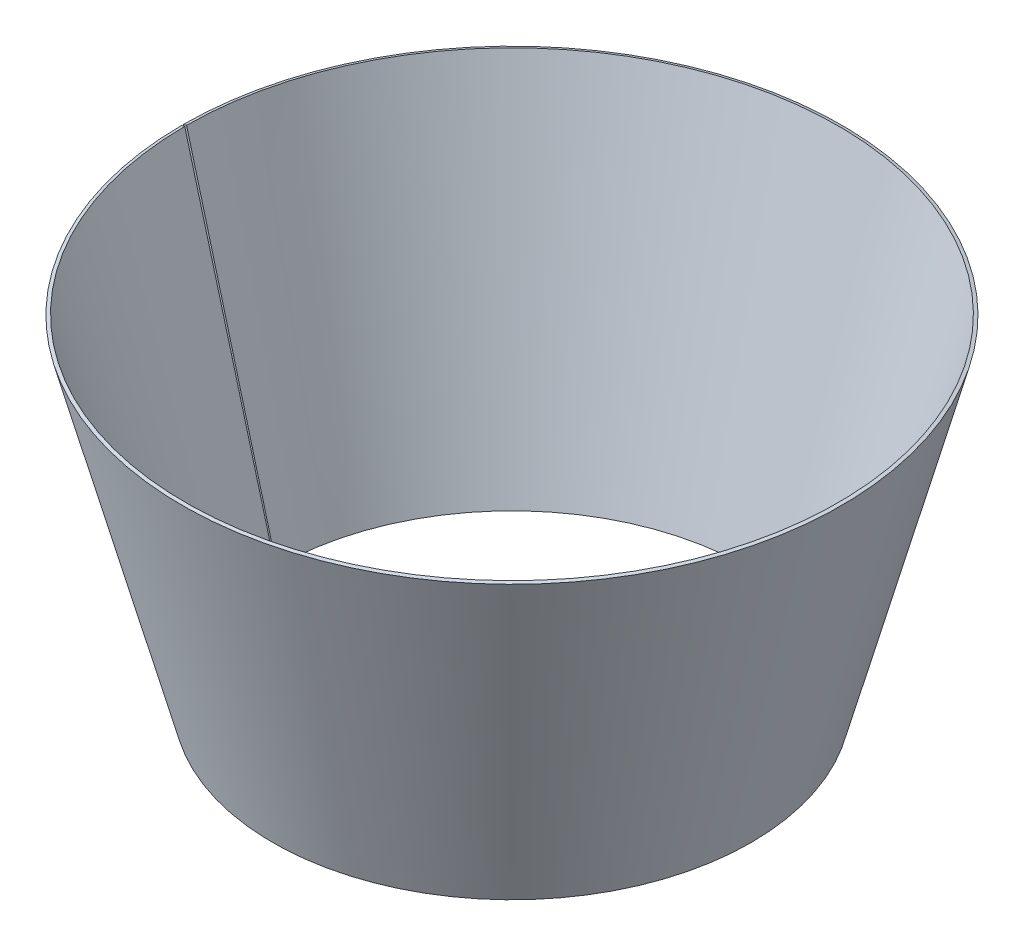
ISO-10303-21;
HEADER;
FILE_DESCRIPTION(('STEP AP214'),'2;1');
FILE_NAME('part.step','',(''),(''),'','','');
FILE_SCHEMA(('AUTOMOTIVE_DESIGN { 1 0 10303 214 1 1 1 1 }'));
ENDSEC;
DATA;
#1=APPLICATION_CONTEXT('core data for automotive mechanical design processes');
#2=APPLICATION_PROTOCOL_DEFINITION('international standard','automotive_design',2000,#1);
#3=PRODUCT_CONTEXT('',#1,'mechanical');
#4=PRODUCT('Part','Part','',(#3));
#5=PRODUCT_RELATED_PRODUCT_CATEGORY('part','',(#4));
#6=PRODUCT_DEFINITION_FORMATION('','',#4);
#7=PRODUCT_DEFINITION_CONTEXT('part definition',#1,'design');
#8=PRODUCT_DEFINITION('design','',#6,#7);
#9=PRODUCT_DEFINITION_SHAPE('','',#8);
#10=(LENGTH_UNIT() NAMED_UNIT(*) SI_UNIT(.MILLI.,.METRE.));
#11=(NAMED_UNIT(*) PLANE_ANGLE_UNIT() SI_UNIT($,.RADIAN.));
#12=(NAMED_UNIT(*) SI_UNIT($,.STERADIAN.) SOLID_ANGLE_UNIT());
#13=UNCERTAINTY_MEASURE_WITH_UNIT(LENGTH_MEASURE(1.E-05),#10,'distance_accuracy_value','');
#14=(GEOMETRIC_REPRESENTATION_CONTEXT(3) GLOBAL_UNCERTAINTY_ASSIGNED_CONTEXT((#13)) GLOBAL_UNIT_ASSIGNED_CONTEXT((#10,
#11,#12)) REPRESENTATION_CONTEXT('',''));
#15=CARTESIAN_POINT('',(0.,0.,0.));
#16=DIRECTION('',(0.,0.,1.));
#17=DIRECTION('',(1.,0.,0.));
#18=AXIS2_PLACEMENT_3D('',#15,#16,#17);
#19=CARTESIAN_POINT('',(0.,99.7411809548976,0.));
#20=DIRECTION('',(0.,-1.,0.));
#21=DIRECTION('',(0.,0.,-1.));
#22=AXIS2_PLACEMENT_3D('',#19,#20,#21);
#23=CONICAL_SURFACE('',#22,97.7608450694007,1.30899693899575);
#24=DIRECTION('',(0.965921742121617,0.258819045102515,-0.00280891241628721));
#25=VECTOR('',#24,1.);
#26=CARTESIAN_POINT('',(-97.76043171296,99.7411809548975,0.284288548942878));
#27=LINE('',#26,#25);
#28=CARTESIAN_POINT('',(-97.76043171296,99.7411809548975,0.284288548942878));
#29=VERTEX_POINT('',#28);
#30=CARTESIAN_POINT('',(-96.7945099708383,100.,0.281479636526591));
#31=VERTEX_POINT('',#30);
#32=EDGE_CURVE('E11',#29,#31,#27,.T.);
#33=ORIENTED_EDGE('',*,*,#32,.F.);
#34=CARTESIAN_POINT('',(0.,99.7411809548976,0.));
#35=DIRECTION('',(0.,1.,-1.9526340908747E-13));
#36=DIRECTION('',(0.,1.9526340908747E-13,1.));
#37=AXIS2_PLACEMENT_3D('',#34,#35,#36);
#38=CIRCLE('',#37,97.7608450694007);
#39=CARTESIAN_POINT('',(-97.76043171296,99.7411809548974,-0.284288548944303));
#40=VERTEX_POINT('',#39);
#41=EDGE_CURVE('E79',#29,#40,#38,.T.);
#42=ORIENTED_EDGE('',*,*,#41,.T.);
#43=DIRECTION('',(0.965921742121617,0.258819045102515,0.00280891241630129));
#44=VECTOR('',#43,1.);
#45=CARTESIAN_POINT('',(-97.76043171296,99.7411809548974,-0.284288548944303));
#46=LINE('',#45,#44);
#47=CARTESIAN_POINT('',(-96.7945099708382,100.,-0.281479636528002));
#48=VERTEX_POINT('',#47);
#49=EDGE_CURVE('E43',#40,#48,#46,.T.);
#50=ORIENTED_EDGE('',*,*,#49,.T.);
#51=CARTESIAN_POINT('',(0.,100.,0.));
#52=DIRECTION('',(0.,1.,0.));
#53=DIRECTION('',(0.,0.,1.));
#54=AXIS2_PLACEMENT_3D('',#51,#52,#53);
#55=CIRCLE('',#54,96.7949192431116);
#56=EDGE_CURVE('E76',#31,#48,#55,.T.);
#57=ORIENTED_EDGE('',*,*,#56,.F.);
#58=EDGE_LOOP('',(#33,#42,#50,#57));
#59=FACE_BOUND('',#58,.T.);
#60=ADVANCED_FACE('F33',(#59),#23,.T.);
#61=CARTESIAN_POINT('',(-97.7604317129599,99.7411809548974,-0.284288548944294));
#62=DIRECTION('',(0.00290800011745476,0.,-0.99999577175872));
#63=DIRECTION('',(0.258817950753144,-0.96592582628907,0.000752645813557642));
#64=AXIS2_PLACEMENT_3D('',#61,#62,#63);
#65=PLANE('',#64);
#66=ORIENTED_EDGE('',*,*,#49,.F.);
#67=DIRECTION('',(0.258817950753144,-0.96592582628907,0.000752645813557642));
#68=VECTOR('',#67,1.);
#69=CARTESIAN_POINT('',(-97.7604317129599,99.7411809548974,-0.284288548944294));
#70=LINE('',#69,#68);
#71=CARTESIAN_POINT('',(-70.965625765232,-0.258819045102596,-0.206368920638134));
#72=VERTEX_POINT('',#71);
#73=EDGE_CURVE('E99',#40,#72,#70,.T.);
#74=ORIENTED_EDGE('',*,*,#73,.T.);
#75=DIRECTION('',(0.965921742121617,0.258819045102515,0.0028089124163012));
#76=VECTOR('',#75,1.);
#77=CARTESIAN_POINT('',(-70.965625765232,-0.258819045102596,-0.206368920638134));
#78=LINE('',#77,#76);
#79=CARTESIAN_POINT('',(-69.9997040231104,0.,-0.203560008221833));
#80=VERTEX_POINT('',#79);
#81=EDGE_CURVE('E66',#72,#80,#78,.T.);
#82=ORIENTED_EDGE('',*,*,#81,.T.);
#83=DIRECTION('',(-0.258817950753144,0.96592582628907,-0.000752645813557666));
#84=VECTOR('',#83,1.);
#85=CARTESIAN_POINT('',(-806.450767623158,2748.48440789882,-2.34516884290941));
#86=LINE('',#85,#84);
#87=EDGE_CURVE('E88',#48,#80,#86,.F.);
#88=ORIENTED_EDGE('',*,*,#87,.F.);
#89=EDGE_LOOP('',(#66,#74,#82,#88));
#90=FACE_BOUND('',#89,.T.);
#91=ADVANCED_FACE('F92',(#90),#65,.F.);
#92=CARTESIAN_POINT('',(0.,-0.258819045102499,0.));
#93=DIRECTION('',(0.,-1.,0.));
#94=DIRECTION('',(0.,0.,-1.));
#95=AXIS2_PLACEMENT_3D('',#92,#93,#94);
#96=CONICAL_SURFACE('',#95,70.9659258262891,1.30899693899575);
#97=ORIENTED_EDGE('',*,*,#81,.F.);
#98=CARTESIAN_POINT('',(0.,-0.258819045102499,0.));
#99=DIRECTION('',(0.,-1.,1.34494940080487E-13));
#100=DIRECTION('',(0.,-1.34494940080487E-13,-1.));
#101=AXIS2_PLACEMENT_3D('',#98,#99,#100);
#102=CIRCLE('',#101,70.9659258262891);
#103=CARTESIAN_POINT('',(-70.965625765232,-0.258819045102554,0.206368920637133));
#104=VERTEX_POINT('',#103);
#105=EDGE_CURVE('E101',#72,#104,#102,.T.);
#106=ORIENTED_EDGE('',*,*,#105,.T.);
#107=DIRECTION('',(0.965921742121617,0.258819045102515,-0.00280891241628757));
#108=VECTOR('',#107,1.);
#109=CARTESIAN_POINT('',(-70.965625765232,-0.258819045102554,0.206368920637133));
#110=LINE('',#109,#108);
#111=CARTESIAN_POINT('',(-69.9997040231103,0.,0.203560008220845));
#112=VERTEX_POINT('',#111);
#113=EDGE_CURVE('E37',#104,#112,#110,.T.);
#114=ORIENTED_EDGE('',*,*,#113,.T.);
#115=CARTESIAN_POINT('',(0.,0.,0.));
#116=DIRECTION('',(0.,1.,0.));
#117=DIRECTION('',(0.,0.,1.));
#118=AXIS2_PLACEMENT_3D('',#115,#116,#117);
#119=CIRCLE('',#118,70.);
#120=EDGE_CURVE('E93',#80,#112,#119,.F.);
#121=ORIENTED_EDGE('',*,*,#120,.F.);
#122=EDGE_LOOP('',(#97,#106,#114,#121));
#123=FACE_BOUND('',#122,.T.);
#124=ADVANCED_FACE('F107',(#123),#96,.F.);
#125=CARTESIAN_POINT('',(-70.965625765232,-0.258819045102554,0.206368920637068));
#126=DIRECTION('',(0.00290800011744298,0.,0.999995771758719));
#127=DIRECTION('',(-0.258817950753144,0.96592582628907,0.000752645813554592));
#128=AXIS2_PLACEMENT_3D('',#125,#126,#127);
#129=PLANE('',#128);
#130=DIRECTION('',(-0.258817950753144,0.96592582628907,0.000752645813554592));
#131=VECTOR('',#130,1.);
#132=CARTESIAN_POINT('',(-70.965625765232,-0.258819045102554,0.206368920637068));
#133=LINE('',#132,#131);
#134=EDGE_CURVE('E90',#104,#29,#133,.T.);
#135=ORIENTED_EDGE('',*,*,#134,.T.);
#136=ORIENTED_EDGE('',*,*,#32,.T.);
#137=DIRECTION('',(-0.258817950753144,0.96592582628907,0.000752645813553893));
#138=VECTOR('',#137,1.);
#139=CARTESIAN_POINT('',(-806.450767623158,2748.48440789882,2.34516884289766));
#140=LINE('',#139,#138);
#141=EDGE_CURVE('E89',#112,#31,#140,.T.);
#142=ORIENTED_EDGE('',*,*,#141,.F.);
#143=ORIENTED_EDGE('',*,*,#113,.F.);
#144=EDGE_LOOP('',(#135,#136,#142,#143));
#145=FACE_BOUND('',#144,.T.);
#146=ADVANCED_FACE('F35',(#145),#129,.F.);
#147=CARTESIAN_POINT('',(0.,2748.48440789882,0.));
#148=DIRECTION('',(0.,1.,0.));
#149=DIRECTION('',(0.,0.,1.));
#150=AXIS2_PLACEMENT_3D('',#147,#148,#149);
#151=CONICAL_SURFACE('',#150,806.454177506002,0.261799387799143);
#152=ORIENTED_EDGE('',*,*,#120,.T.);
#153=ORIENTED_EDGE('',*,*,#141,.T.);
#154=ORIENTED_EDGE('',*,*,#56,.T.);
#155=ORIENTED_EDGE('',*,*,#87,.T.);
#156=EDGE_LOOP('',(#152,#153,#154,#155));
#157=FACE_BOUND('',#156,.T.);
#158=ADVANCED_FACE('F87',(#157),#151,.F.);
#159=CARTESIAN_POINT('',(0.,2748.22558885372,0.));
#160=DIRECTION('',(0.,1.,0.));
#161=DIRECTION('',(0.,0.,1.));
#162=AXIS2_PLACEMENT_3D('',#159,#160,#161);
#163=CONICAL_SURFACE('',#162,807.420103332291,0.261799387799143);
#164=ORIENTED_EDGE('',*,*,#105,.F.);
#165=ORIENTED_EDGE('',*,*,#73,.F.);
#166=ORIENTED_EDGE('',*,*,#41,.F.);
#167=ORIENTED_EDGE('',*,*,#134,.F.);
#168=EDGE_LOOP('',(#164,#165,#166,#167));
#169=FACE_BOUND('',#168,.T.);
#170=ADVANCED_FACE('F106',(#169),#163,.T.);
#171=CLOSED_SHELL('',(#60,#91,#124,#146,#158,#170));
#172=MANIFOLD_SOLID_BREP('B2',#171);
#173=ADVANCED_BREP_SHAPE_REPRESENTATION('',(#18,#172),#14);
#174=SHAPE_DEFINITION_REPRESENTATION(#9,#173);
ENDSEC;
END-ISO-10303-21;
